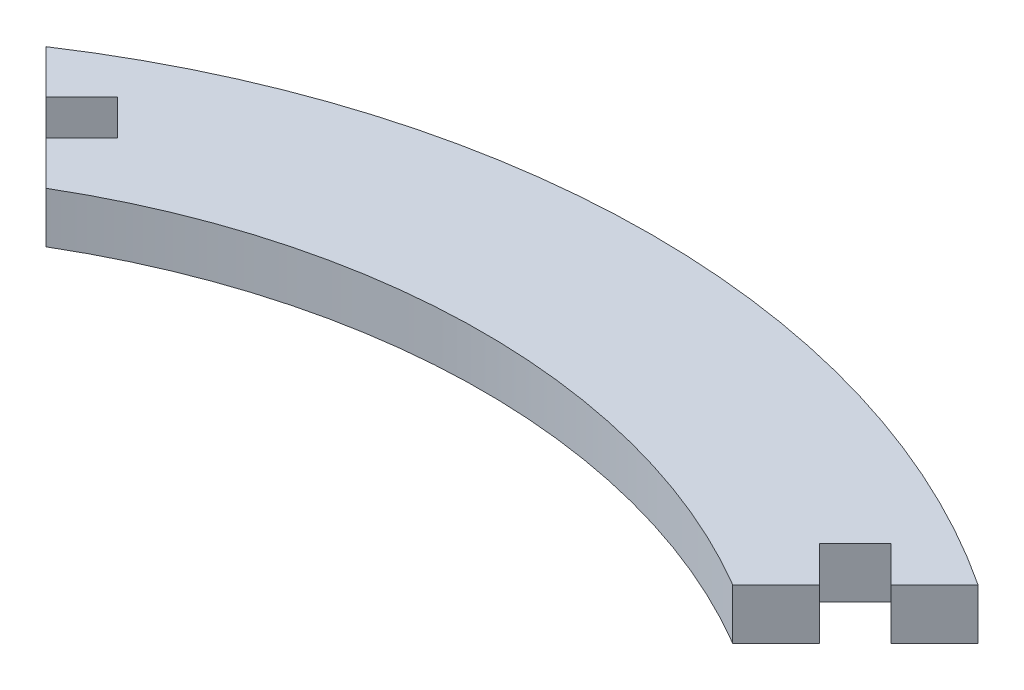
ISO-10303-21;
HEADER;
FILE_DESCRIPTION(('STEP AP214'),'2;1');
FILE_NAME('part.step','',(''),(''),'','','');
FILE_SCHEMA(('AUTOMOTIVE_DESIGN { 1 0 10303 214 1 1 1 1 }'));
ENDSEC;
DATA;
#1=APPLICATION_CONTEXT('core data for automotive mechanical design processes');
#2=APPLICATION_PROTOCOL_DEFINITION('international standard','automotive_design',2000,#1);
#3=PRODUCT_CONTEXT('',#1,'mechanical');
#4=PRODUCT('Part','Part','',(#3));
#5=PRODUCT_RELATED_PRODUCT_CATEGORY('part','',(#4));
#6=PRODUCT_DEFINITION_FORMATION('','',#4);
#7=PRODUCT_DEFINITION_CONTEXT('part definition',#1,'design');
#8=PRODUCT_DEFINITION('design','',#6,#7);
#9=PRODUCT_DEFINITION_SHAPE('','',#8);
#10=(LENGTH_UNIT() NAMED_UNIT(*) SI_UNIT(.MILLI.,.METRE.));
#11=(NAMED_UNIT(*) PLANE_ANGLE_UNIT() SI_UNIT($,.RADIAN.));
#12=(NAMED_UNIT(*) SI_UNIT($,.STERADIAN.) SOLID_ANGLE_UNIT());
#13=UNCERTAINTY_MEASURE_WITH_UNIT(LENGTH_MEASURE(1.E-05),#10,'distance_accuracy_value','');
#14=(GEOMETRIC_REPRESENTATION_CONTEXT(3) GLOBAL_UNCERTAINTY_ASSIGNED_CONTEXT((#13)) GLOBAL_UNIT_ASSIGNED_CONTEXT((#10,
#11,#12)) REPRESENTATION_CONTEXT('',''));
#15=CARTESIAN_POINT('',(0.,0.,0.));
#16=DIRECTION('',(0.,0.,1.));
#17=DIRECTION('',(1.,0.,0.));
#18=AXIS2_PLACEMENT_3D('',#15,#16,#17);
#19=CARTESIAN_POINT('',(-27.569948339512,3.,-41.7120839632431));
#20=DIRECTION('',(0.707106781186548,0.,-0.707106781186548));
#21=DIRECTION('',(-0.707106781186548,0.,-0.707106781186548));
#22=AXIS2_PLACEMENT_3D('',#19,#20,#21);
#23=PLANE('',#22);
#24=DIRECTION('',(0.707106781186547,0.,0.707106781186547));
#25=VECTOR('',#24,1.);
#26=CARTESIAN_POINT('',(-27.569948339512,0.,-41.7120839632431));
#27=LINE('',#26,#25);
#28=CARTESIAN_POINT('',(-27.569948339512,0.,-41.7120839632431));
#29=VERTEX_POINT('',#28);
#30=CARTESIAN_POINT('',(-25.0031643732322,0.,-39.1452999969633));
#31=VERTEX_POINT('',#30);
#32=EDGE_CURVE('E136',#29,#31,#27,.T.);
#33=ORIENTED_EDGE('',*,*,#32,.T.);
#34=DIRECTION('',(0.,1.,0.));
#35=VECTOR('',#34,1.);
#36=CARTESIAN_POINT('',(-25.0031643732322,0.,-39.1452999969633));
#37=LINE('',#36,#35);
#38=CARTESIAN_POINT('',(-25.0031643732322,3.,-39.1452999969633));
#39=VERTEX_POINT('',#38);
#40=EDGE_CURVE('E122',#31,#39,#37,.T.);
#41=ORIENTED_EDGE('',*,*,#40,.T.);
#42=DIRECTION('',(0.707106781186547,0.,0.707106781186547));
#43=VECTOR('',#42,1.);
#44=CARTESIAN_POINT('',(-27.569948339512,3.,-41.7120839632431));
#45=LINE('',#44,#43);
#46=CARTESIAN_POINT('',(-27.569948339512,3.,-41.7120839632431));
#47=VERTEX_POINT('',#46);
#48=EDGE_CURVE('E188',#47,#39,#45,.T.);
#49=ORIENTED_EDGE('',*,*,#48,.F.);
#50=DIRECTION('',(0.,-1.,0.));
#51=VECTOR('',#50,1.);
#52=CARTESIAN_POINT('',(-27.569948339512,3.,-41.7120839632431));
#53=LINE('',#52,#51);
#54=EDGE_CURVE('E11',#47,#29,#53,.T.);
#55=ORIENTED_EDGE('',*,*,#54,.T.);
#56=EDGE_LOOP('',(#33,#41,#49,#55));
#57=FACE_BOUND('',#56,.T.);
#58=ADVANCED_FACE('F33',(#57),#23,.F.);
#59=CARTESIAN_POINT('',(27.569948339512,3.,-41.7120839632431));
#60=DIRECTION('',(-0.707106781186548,0.,-0.707106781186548));
#61=DIRECTION('',(-0.707106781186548,0.,0.707106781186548));
#62=AXIS2_PLACEMENT_3D('',#59,#60,#61);
#63=PLANE('',#62);
#64=DIRECTION('',(0.707106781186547,0.,-0.707106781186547));
#65=VECTOR('',#64,1.);
#66=CARTESIAN_POINT('',(27.569948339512,0.,-41.7120839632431));
#67=LINE('',#66,#65);
#68=CARTESIAN_POINT('',(20.3150600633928,0.,-34.4571956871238));
#69=VERTEX_POINT('',#68);
#70=CARTESIAN_POINT('',(22.8818440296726,0.,-37.0239796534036));
#71=VERTEX_POINT('',#70);
#72=EDGE_CURVE('E152',#69,#71,#67,.T.);
#73=ORIENTED_EDGE('',*,*,#72,.T.);
#74=DIRECTION('',(0.,1.,0.));
#75=VECTOR('',#74,1.);
#76=CARTESIAN_POINT('',(22.8818440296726,0.,-37.0239796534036));
#77=LINE('',#76,#75);
#78=CARTESIAN_POINT('',(22.8818440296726,3.,-37.0239796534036));
#79=VERTEX_POINT('',#78);
#80=EDGE_CURVE('E181',#71,#79,#77,.T.);
#81=ORIENTED_EDGE('',*,*,#80,.T.);
#82=DIRECTION('',(0.707106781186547,0.,-0.707106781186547));
#83=VECTOR('',#82,1.);
#84=CARTESIAN_POINT('',(27.569948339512,3.,-41.7120839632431));
#85=LINE('',#84,#83);
#86=CARTESIAN_POINT('',(20.3150600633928,3.,-34.4571956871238));
#87=VERTEX_POINT('',#86);
#88=EDGE_CURVE('E160',#87,#79,#85,.T.);
#89=ORIENTED_EDGE('',*,*,#88,.F.);
#90=DIRECTION('',(0.,-1.,0.));
#91=VECTOR('',#90,1.);
#92=CARTESIAN_POINT('',(20.3150600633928,3.,-34.4571956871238));
#93=LINE('',#92,#91);
#94=EDGE_CURVE('E159',#87,#69,#93,.T.);
#95=ORIENTED_EDGE('',*,*,#94,.T.);
#96=EDGE_LOOP('',(#73,#81,#89,#95));
#97=FACE_BOUND('',#96,.T.);
#98=ADVANCED_FACE('F179',(#97),#63,.F.);
#99=CARTESIAN_POINT('',(0.,3.,0.));
#100=DIRECTION('',(0.,-1.,0.));
#101=DIRECTION('',(0.,0.,-1.));
#102=AXIS2_PLACEMENT_3D('',#99,#100,#101);
#103=CYLINDRICAL_SURFACE('',#102,50.);
#104=CARTESIAN_POINT('',(0.,0.,0.));
#105=DIRECTION('',(0.,1.,0.));
#106=DIRECTION('',(0.,0.,1.));
#107=AXIS2_PLACEMENT_3D('',#104,#105,#106);
#108=CIRCLE('',#107,50.);
#109=CARTESIAN_POINT('',(27.569948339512,0.,-41.7120839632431));
#110=VERTEX_POINT('',#109);
#111=EDGE_CURVE('E148',#110,#29,#108,.T.);
#112=ORIENTED_EDGE('',*,*,#111,.T.);
#113=ORIENTED_EDGE('',*,*,#54,.F.);
#114=CARTESIAN_POINT('',(0.,3.,0.));
#115=DIRECTION('',(0.,1.,0.));
#116=DIRECTION('',(0.,0.,1.));
#117=AXIS2_PLACEMENT_3D('',#114,#115,#116);
#118=CIRCLE('',#117,50.);
#119=CARTESIAN_POINT('',(27.569948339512,3.,-41.7120839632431));
#120=VERTEX_POINT('',#119);
#121=EDGE_CURVE('E155',#120,#47,#118,.T.);
#122=ORIENTED_EDGE('',*,*,#121,.F.);
#123=DIRECTION('',(0.,-1.,0.));
#124=VECTOR('',#123,1.);
#125=CARTESIAN_POINT('',(27.569948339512,3.,-41.7120839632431));
#126=LINE('',#125,#124);
#127=EDGE_CURVE('E156',#120,#110,#126,.T.);
#128=ORIENTED_EDGE('',*,*,#127,.T.);
#129=EDGE_LOOP('',(#112,#113,#122,#128));
#130=FACE_BOUND('',#129,.T.);
#131=ADVANCED_FACE('F35',(#130),#103,.T.);
#132=CARTESIAN_POINT('',(-22.8818440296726,3.,-37.0239796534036));
#133=VERTEX_POINT('',#132);
#134=CARTESIAN_POINT('',(-20.3150600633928,3.,-34.4571956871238));
#135=VERTEX_POINT('',#134);
#136=EDGE_CURVE('E190',#133,#135,#45,.T.);
#137=ORIENTED_EDGE('',*,*,#136,.F.);
#138=DIRECTION('',(0.,1.,0.));
#139=VECTOR('',#138,1.);
#140=CARTESIAN_POINT('',(-22.8818440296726,0.,-37.0239796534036));
#141=LINE('',#140,#139);
#142=CARTESIAN_POINT('',(-22.8818440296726,0.,-37.0239796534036));
#143=VERTEX_POINT('',#142);
#144=EDGE_CURVE('E131',#143,#133,#141,.T.);
#145=ORIENTED_EDGE('',*,*,#144,.F.);
#146=CARTESIAN_POINT('',(-20.3150600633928,0.,-34.4571956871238));
#147=VERTEX_POINT('',#146);
#148=EDGE_CURVE('E144',#143,#147,#27,.T.);
#149=ORIENTED_EDGE('',*,*,#148,.T.);
#150=DIRECTION('',(0.,-1.,0.));
#151=VECTOR('',#150,1.);
#152=CARTESIAN_POINT('',(-20.3150600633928,3.,-34.4571956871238));
#153=LINE('',#152,#151);
#154=EDGE_CURVE('E41',#135,#147,#153,.T.);
#155=ORIENTED_EDGE('',*,*,#154,.F.);
#156=EDGE_LOOP('',(#137,#145,#149,#155));
#157=FACE_BOUND('',#156,.T.);
#158=ADVANCED_FACE('F229',(#157),#23,.F.);
#159=CARTESIAN_POINT('',(0.,3.,0.));
#160=DIRECTION('',(0.,-1.,0.));
#161=DIRECTION('',(0.,0.,-1.));
#162=AXIS2_PLACEMENT_3D('',#159,#160,#161);
#163=CYLINDRICAL_SURFACE('',#162,40.);
#164=CARTESIAN_POINT('',(0.,0.,0.));
#165=DIRECTION('',(0.,-1.,0.));
#166=DIRECTION('',(0.,0.,1.));
#167=AXIS2_PLACEMENT_3D('',#164,#165,#166);
#168=CIRCLE('',#167,40.);
#169=EDGE_CURVE('E143',#147,#69,#168,.T.);
#170=ORIENTED_EDGE('',*,*,#169,.T.);
#171=ORIENTED_EDGE('',*,*,#94,.F.);
#172=CARTESIAN_POINT('',(0.,3.,0.));
#173=DIRECTION('',(0.,-1.,0.));
#174=DIRECTION('',(0.,0.,1.));
#175=AXIS2_PLACEMENT_3D('',#172,#173,#174);
#176=CIRCLE('',#175,40.);
#177=EDGE_CURVE('E169',#135,#87,#176,.T.);
#178=ORIENTED_EDGE('',*,*,#177,.F.);
#179=ORIENTED_EDGE('',*,*,#154,.T.);
#180=EDGE_LOOP('',(#170,#171,#178,#179));
#181=FACE_BOUND('',#180,.T.);
#182=ADVANCED_FACE('F167',(#181),#163,.F.);
#183=CARTESIAN_POINT('',(25.0031643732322,3.,-39.1452999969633));
#184=VERTEX_POINT('',#183);
#185=EDGE_CURVE('E185',#184,#120,#85,.T.);
#186=ORIENTED_EDGE('',*,*,#185,.F.);
#187=DIRECTION('',(0.,1.,0.));
#188=VECTOR('',#187,1.);
#189=CARTESIAN_POINT('',(25.0031643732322,0.,-39.1452999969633));
#190=LINE('',#189,#188);
#191=CARTESIAN_POINT('',(25.0031643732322,0.,-39.1452999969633));
#192=VERTEX_POINT('',#191);
#193=EDGE_CURVE('E193',#192,#184,#190,.T.);
#194=ORIENTED_EDGE('',*,*,#193,.F.);
#195=EDGE_CURVE('E146',#192,#110,#67,.T.);
#196=ORIENTED_EDGE('',*,*,#195,.T.);
#197=ORIENTED_EDGE('',*,*,#127,.F.);
#198=EDGE_LOOP('',(#186,#194,#196,#197));
#199=FACE_BOUND('',#198,.T.);
#200=ADVANCED_FACE('F247',(#199),#63,.F.);
#201=CARTESIAN_POINT('',(0.,3.,0.));
#202=DIRECTION('',(0.,1.,0.));
#203=DIRECTION('',(0.,0.,1.));
#204=AXIS2_PLACEMENT_3D('',#201,#202,#203);
#205=PLANE('',#204);
#206=DIRECTION('',(-0.707106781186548,0.,0.707106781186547));
#207=VECTOR('',#206,1.);
#208=CARTESIAN_POINT('',(-25.0031643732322,3.,-39.1452999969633));
#209=LINE('',#208,#207);
#210=CARTESIAN_POINT('',(-22.8818440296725,3.,-41.2666203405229));
#211=VERTEX_POINT('',#210);
#212=EDGE_CURVE('E127',#211,#39,#209,.T.);
#213=ORIENTED_EDGE('',*,*,#212,.F.);
#214=DIRECTION('',(-0.707106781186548,0.,-0.707106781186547));
#215=VECTOR('',#214,1.);
#216=CARTESIAN_POINT('',(-22.8818440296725,3.,-41.2666203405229));
#217=LINE('',#216,#215);
#218=CARTESIAN_POINT('',(-20.7605236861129,3.,-39.1452999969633));
#219=VERTEX_POINT('',#218);
#220=EDGE_CURVE('E139',#219,#211,#217,.T.);
#221=ORIENTED_EDGE('',*,*,#220,.F.);
#222=DIRECTION('',(0.707106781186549,0.,-0.707106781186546));
#223=VECTOR('',#222,1.);
#224=CARTESIAN_POINT('',(-22.8818440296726,3.,-37.0239796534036));
#225=LINE('',#224,#223);
#226=EDGE_CURVE('E220',#133,#219,#225,.T.);
#227=ORIENTED_EDGE('',*,*,#226,.F.);
#228=ORIENTED_EDGE('',*,*,#136,.T.);
#229=ORIENTED_EDGE('',*,*,#177,.T.);
#230=ORIENTED_EDGE('',*,*,#88,.T.);
#231=DIRECTION('',(0.707106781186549,0.,0.707106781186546));
#232=VECTOR('',#231,1.);
#233=CARTESIAN_POINT('',(22.8818440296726,3.,-37.0239796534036));
#234=LINE('',#233,#232);
#235=CARTESIAN_POINT('',(20.7605236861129,3.,-39.1452999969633));
#236=VERTEX_POINT('',#235);
#237=EDGE_CURVE('E200',#236,#79,#234,.T.);
#238=ORIENTED_EDGE('',*,*,#237,.F.);
#239=DIRECTION('',(-0.707106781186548,0.,0.707106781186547));
#240=VECTOR('',#239,1.);
#241=CARTESIAN_POINT('',(22.8818440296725,3.,-41.2666203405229));
#242=LINE('',#241,#240);
#243=CARTESIAN_POINT('',(22.8818440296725,3.,-41.2666203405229));
#244=VERTEX_POINT('',#243);
#245=EDGE_CURVE('E203',#244,#236,#242,.T.);
#246=ORIENTED_EDGE('',*,*,#245,.F.);
#247=DIRECTION('',(-0.707106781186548,0.,-0.707106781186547));
#248=VECTOR('',#247,1.);
#249=CARTESIAN_POINT('',(25.0031643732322,3.,-39.1452999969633));
#250=LINE('',#249,#248);
#251=EDGE_CURVE('E206',#184,#244,#250,.T.);
#252=ORIENTED_EDGE('',*,*,#251,.F.);
#253=ORIENTED_EDGE('',*,*,#185,.T.);
#254=ORIENTED_EDGE('',*,*,#121,.T.);
#255=ORIENTED_EDGE('',*,*,#48,.T.);
#256=EDGE_LOOP('',(#213,#221,#227,#228,#229,#230,#238,#246,#252,#253,#254,#255));
#257=FACE_BOUND('',#256,.T.);
#258=ADVANCED_FACE('F230',(#257),#205,.T.);
#259=CARTESIAN_POINT('',(0.,0.,0.));
#260=DIRECTION('',(0.,1.,0.));
#261=DIRECTION('',(0.,0.,1.));
#262=AXIS2_PLACEMENT_3D('',#259,#260,#261);
#263=PLANE('',#262);
#264=DIRECTION('',(-0.707106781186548,0.,-0.707106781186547));
#265=VECTOR('',#264,1.);
#266=CARTESIAN_POINT('',(-22.8818440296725,0.,-41.2666203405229));
#267=LINE('',#266,#265);
#268=CARTESIAN_POINT('',(-20.7605236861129,0.,-39.1452999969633));
#269=VERTEX_POINT('',#268);
#270=CARTESIAN_POINT('',(-22.8818440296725,0.,-41.2666203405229));
#271=VERTEX_POINT('',#270);
#272=EDGE_CURVE('E48',#269,#271,#267,.T.);
#273=ORIENTED_EDGE('',*,*,#272,.T.);
#274=DIRECTION('',(-0.707106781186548,0.,0.707106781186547));
#275=VECTOR('',#274,1.);
#276=CARTESIAN_POINT('',(-25.0031643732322,0.,-39.1452999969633));
#277=LINE('',#276,#275);
#278=EDGE_CURVE('E125',#271,#31,#277,.T.);
#279=ORIENTED_EDGE('',*,*,#278,.T.);
#280=ORIENTED_EDGE('',*,*,#32,.F.);
#281=ORIENTED_EDGE('',*,*,#111,.F.);
#282=ORIENTED_EDGE('',*,*,#195,.F.);
#283=DIRECTION('',(-0.707106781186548,0.,-0.707106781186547));
#284=VECTOR('',#283,1.);
#285=CARTESIAN_POINT('',(25.0031643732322,0.,-39.1452999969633));
#286=LINE('',#285,#284);
#287=CARTESIAN_POINT('',(22.8818440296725,0.,-41.2666203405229));
#288=VERTEX_POINT('',#287);
#289=EDGE_CURVE('E202',#192,#288,#286,.T.);
#290=ORIENTED_EDGE('',*,*,#289,.T.);
#291=DIRECTION('',(-0.707106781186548,0.,0.707106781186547));
#292=VECTOR('',#291,1.);
#293=CARTESIAN_POINT('',(22.8818440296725,0.,-41.2666203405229));
#294=LINE('',#293,#292);
#295=CARTESIAN_POINT('',(20.7605236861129,0.,-39.1452999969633));
#296=VERTEX_POINT('',#295);
#297=EDGE_CURVE('E56',#288,#296,#294,.T.);
#298=ORIENTED_EDGE('',*,*,#297,.T.);
#299=DIRECTION('',(0.707106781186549,0.,0.707106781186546));
#300=VECTOR('',#299,1.);
#301=CARTESIAN_POINT('',(22.8818440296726,0.,-37.0239796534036));
#302=LINE('',#301,#300);
#303=EDGE_CURVE('E176',#296,#71,#302,.T.);
#304=ORIENTED_EDGE('',*,*,#303,.T.);
#305=ORIENTED_EDGE('',*,*,#72,.F.);
#306=ORIENTED_EDGE('',*,*,#169,.F.);
#307=ORIENTED_EDGE('',*,*,#148,.F.);
#308=DIRECTION('',(0.707106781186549,0.,-0.707106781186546));
#309=VECTOR('',#308,1.);
#310=CARTESIAN_POINT('',(-22.8818440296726,0.,-37.0239796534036));
#311=LINE('',#310,#309);
#312=EDGE_CURVE('E138',#143,#269,#311,.T.);
#313=ORIENTED_EDGE('',*,*,#312,.T.);
#314=EDGE_LOOP('',(#273,#279,#280,#281,#282,#290,#298,#304,#305,#306,#307,#313));
#315=FACE_BOUND('',#314,.T.);
#316=ADVANCED_FACE('F134',(#315),#263,.F.);
#317=CARTESIAN_POINT('',(22.8818440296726,0.,-37.0239796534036));
#318=DIRECTION('',(-0.707106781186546,0.,0.707106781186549));
#319=DIRECTION('',(0.707106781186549,0.,0.707106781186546));
#320=AXIS2_PLACEMENT_3D('',#317,#318,#319);
#321=PLANE('',#320);
#322=ORIENTED_EDGE('',*,*,#237,.T.);
#323=ORIENTED_EDGE('',*,*,#80,.F.);
#324=ORIENTED_EDGE('',*,*,#303,.F.);
#325=DIRECTION('',(0.,1.,0.));
#326=VECTOR('',#325,1.);
#327=CARTESIAN_POINT('',(20.7605236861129,0.,-39.1452999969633));
#328=LINE('',#327,#326);
#329=EDGE_CURVE('E197',#296,#236,#328,.T.);
#330=ORIENTED_EDGE('',*,*,#329,.T.);
#331=EDGE_LOOP('',(#322,#323,#324,#330));
#332=FACE_BOUND('',#331,.T.);
#333=ADVANCED_FACE('F268',(#332),#321,.F.);
#334=CARTESIAN_POINT('',(22.8818440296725,0.,-41.2666203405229));
#335=DIRECTION('',(-0.707106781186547,0.,-0.707106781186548));
#336=DIRECTION('',(-0.707106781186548,0.,0.707106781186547));
#337=AXIS2_PLACEMENT_3D('',#334,#335,#336);
#338=PLANE('',#337);
#339=ORIENTED_EDGE('',*,*,#245,.T.);
#340=ORIENTED_EDGE('',*,*,#329,.F.);
#341=ORIENTED_EDGE('',*,*,#297,.F.);
#342=DIRECTION('',(0.,1.,0.));
#343=VECTOR('',#342,1.);
#344=CARTESIAN_POINT('',(22.8818440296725,0.,-41.2666203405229));
#345=LINE('',#344,#343);
#346=EDGE_CURVE('E195',#288,#244,#345,.T.);
#347=ORIENTED_EDGE('',*,*,#346,.T.);
#348=EDGE_LOOP('',(#339,#340,#341,#347));
#349=FACE_BOUND('',#348,.T.);
#350=ADVANCED_FACE('F266',(#349),#338,.F.);
#351=CARTESIAN_POINT('',(25.0031643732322,0.,-39.1452999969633));
#352=DIRECTION('',(0.707106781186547,0.,-0.707106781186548));
#353=DIRECTION('',(-0.707106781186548,0.,-0.707106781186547));
#354=AXIS2_PLACEMENT_3D('',#351,#352,#353);
#355=PLANE('',#354);
#356=ORIENTED_EDGE('',*,*,#251,.T.);
#357=ORIENTED_EDGE('',*,*,#346,.F.);
#358=ORIENTED_EDGE('',*,*,#289,.F.);
#359=ORIENTED_EDGE('',*,*,#193,.T.);
#360=EDGE_LOOP('',(#356,#357,#358,#359));
#361=FACE_BOUND('',#360,.T.);
#362=ADVANCED_FACE('F240',(#361),#355,.F.);
#363=CARTESIAN_POINT('',(-25.0031643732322,0.,-39.1452999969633));
#364=DIRECTION('',(-0.707106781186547,0.,-0.707106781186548));
#365=DIRECTION('',(-0.707106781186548,0.,0.707106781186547));
#366=AXIS2_PLACEMENT_3D('',#363,#364,#365);
#367=PLANE('',#366);
#368=ORIENTED_EDGE('',*,*,#212,.T.);
#369=ORIENTED_EDGE('',*,*,#40,.F.);
#370=ORIENTED_EDGE('',*,*,#278,.F.);
#371=DIRECTION('',(0.,1.,0.));
#372=VECTOR('',#371,1.);
#373=CARTESIAN_POINT('',(-22.8818440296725,0.,-41.2666203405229));
#374=LINE('',#373,#372);
#375=EDGE_CURVE('E209',#271,#211,#374,.T.);
#376=ORIENTED_EDGE('',*,*,#375,.T.);
#377=EDGE_LOOP('',(#368,#369,#370,#376));
#378=FACE_BOUND('',#377,.T.);
#379=ADVANCED_FACE('F124',(#378),#367,.F.);
#380=CARTESIAN_POINT('',(-22.8818440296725,0.,-41.2666203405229));
#381=DIRECTION('',(0.707106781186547,0.,-0.707106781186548));
#382=DIRECTION('',(-0.707106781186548,0.,-0.707106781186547));
#383=AXIS2_PLACEMENT_3D('',#380,#381,#382);
#384=PLANE('',#383);
#385=ORIENTED_EDGE('',*,*,#220,.T.);
#386=ORIENTED_EDGE('',*,*,#375,.F.);
#387=ORIENTED_EDGE('',*,*,#272,.F.);
#388=DIRECTION('',(0.,1.,0.));
#389=VECTOR('',#388,1.);
#390=CARTESIAN_POINT('',(-20.7605236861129,0.,-39.1452999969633));
#391=LINE('',#390,#389);
#392=EDGE_CURVE('E215',#269,#219,#391,.T.);
#393=ORIENTED_EDGE('',*,*,#392,.T.);
#394=EDGE_LOOP('',(#385,#386,#387,#393));
#395=FACE_BOUND('',#394,.T.);
#396=ADVANCED_FACE('F232',(#395),#384,.F.);
#397=CARTESIAN_POINT('',(-22.8818440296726,0.,-37.0239796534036));
#398=DIRECTION('',(0.707106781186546,0.,0.707106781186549));
#399=DIRECTION('',(0.707106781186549,0.,-0.707106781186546));
#400=AXIS2_PLACEMENT_3D('',#397,#398,#399);
#401=PLANE('',#400);
#402=ORIENTED_EDGE('',*,*,#226,.T.);
#403=ORIENTED_EDGE('',*,*,#392,.F.);
#404=ORIENTED_EDGE('',*,*,#312,.F.);
#405=ORIENTED_EDGE('',*,*,#144,.T.);
#406=EDGE_LOOP('',(#402,#403,#404,#405));
#407=FACE_BOUND('',#406,.T.);
#408=ADVANCED_FACE('F227',(#407),#401,.F.);
#409=CLOSED_SHELL('',(#58,#98,#131,#158,#182,#200,#258,#316,#333,#350,#362,#379,#396,#408));
#410=MANIFOLD_SOLID_BREP('B2',#409);
#411=ADVANCED_BREP_SHAPE_REPRESENTATION('',(#18,#410),#14);
#412=SHAPE_DEFINITION_REPRESENTATION(#9,#411);
ENDSEC;
END-ISO-10303-21;
